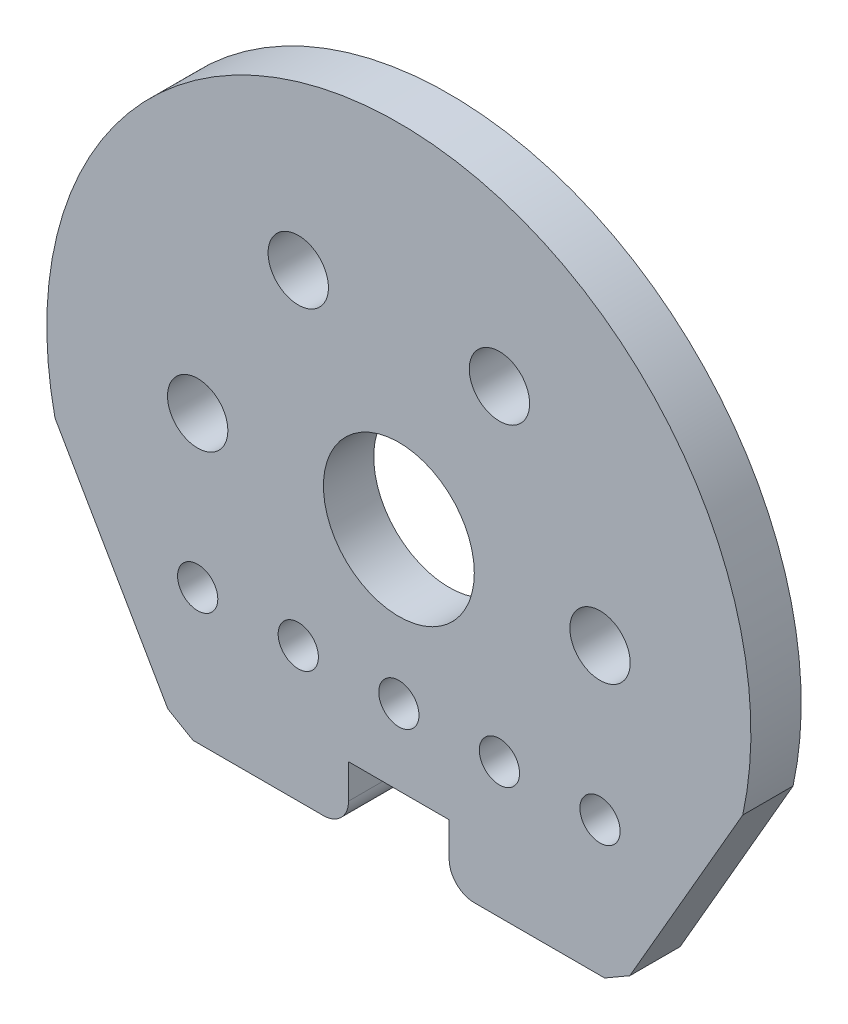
ISO-10303-21;
HEADER;
FILE_DESCRIPTION(('STEP AP214'),'2;1');
FILE_NAME('part.step','',(''),(''),'','','');
FILE_SCHEMA(('AUTOMOTIVE_DESIGN { 1 0 10303 214 1 1 1 1 }'));
ENDSEC;
DATA;
#1=APPLICATION_CONTEXT('core data for automotive mechanical design processes');
#2=APPLICATION_PROTOCOL_DEFINITION('international standard','automotive_design',2000,#1);
#3=PRODUCT_CONTEXT('',#1,'mechanical');
#4=PRODUCT('Part','Part','',(#3));
#5=PRODUCT_RELATED_PRODUCT_CATEGORY('part','',(#4));
#6=PRODUCT_DEFINITION_FORMATION('','',#4);
#7=PRODUCT_DEFINITION_CONTEXT('part definition',#1,'design');
#8=PRODUCT_DEFINITION('design','',#6,#7);
#9=PRODUCT_DEFINITION_SHAPE('','',#8);
#10=(LENGTH_UNIT() NAMED_UNIT(*) SI_UNIT(.MILLI.,.METRE.));
#11=(NAMED_UNIT(*) PLANE_ANGLE_UNIT() SI_UNIT($,.RADIAN.));
#12=(NAMED_UNIT(*) SI_UNIT($,.STERADIAN.) SOLID_ANGLE_UNIT());
#13=UNCERTAINTY_MEASURE_WITH_UNIT(LENGTH_MEASURE(1.E-05),#10,'distance_accuracy_value','');
#14=(GEOMETRIC_REPRESENTATION_CONTEXT(3) GLOBAL_UNCERTAINTY_ASSIGNED_CONTEXT((#13)) GLOBAL_UNIT_ASSIGNED_CONTEXT((#10,
#11,#12)) REPRESENTATION_CONTEXT('',''));
#15=CARTESIAN_POINT('',(0.,0.,0.));
#16=DIRECTION('',(0.,0.,1.));
#17=DIRECTION('',(1.,0.,0.));
#18=AXIS2_PLACEMENT_3D('',#15,#16,#17);
#19=CARTESIAN_POINT('',(0.,0.,10.));
#20=DIRECTION('',(0.,0.,1.));
#21=DIRECTION('',(1.,0.,0.));
#22=AXIS2_PLACEMENT_3D('',#19,#20,#21);
#23=PLANE('',#22);
#24=CARTESIAN_POINT('',(20.,-30.,10.));
#25=DIRECTION('',(0.,0.,1.));
#26=DIRECTION('',(1.,0.,0.));
#27=AXIS2_PLACEMENT_3D('',#24,#25,#26);
#28=CIRCLE('',#27,4.);
#29=CARTESIAN_POINT('',(24.,-30.,10.));
#30=VERTEX_POINT('',#29);
#31=EDGE_CURVE('E316',#30,#30,#28,.T.);
#32=ORIENTED_EDGE('',*,*,#31,.F.);
#33=EDGE_LOOP('',(#32));
#34=FACE_BOUND('',#33,.T.);
#35=CARTESIAN_POINT('',(-20.,-30.,10.));
#36=DIRECTION('',(0.,0.,1.));
#37=DIRECTION('',(1.,0.,0.));
#38=AXIS2_PLACEMENT_3D('',#35,#36,#37);
#39=CIRCLE('',#38,4.);
#40=CARTESIAN_POINT('',(-16.,-30.,10.));
#41=VERTEX_POINT('',#40);
#42=EDGE_CURVE('E328',#41,#41,#39,.T.);
#43=ORIENTED_EDGE('',*,*,#42,.F.);
#44=EDGE_LOOP('',(#43));
#45=FACE_BOUND('',#44,.T.);
#46=CARTESIAN_POINT('',(40.,0.,10.));
#47=DIRECTION('',(0.,0.,1.));
#48=DIRECTION('',(1.,0.,0.));
#49=AXIS2_PLACEMENT_3D('',#46,#47,#48);
#50=CIRCLE('',#49,5.99999999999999);
#51=CARTESIAN_POINT('',(46.,0.,10.));
#52=VERTEX_POINT('',#51);
#53=EDGE_CURVE('E340',#52,#52,#50,.T.);
#54=ORIENTED_EDGE('',*,*,#53,.F.);
#55=EDGE_LOOP('',(#54));
#56=FACE_BOUND('',#55,.T.);
#57=CARTESIAN_POINT('',(-20.0000000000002,34.6410161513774,10.));
#58=DIRECTION('',(0.,0.,1.));
#59=DIRECTION('',(1.,0.,0.));
#60=AXIS2_PLACEMENT_3D('',#57,#58,#59);
#61=CIRCLE('',#60,6.);
#62=CARTESIAN_POINT('',(-14.0000000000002,34.6410161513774,10.));
#63=VERTEX_POINT('',#62);
#64=EDGE_CURVE('E352',#63,#63,#61,.T.);
#65=ORIENTED_EDGE('',*,*,#64,.F.);
#66=EDGE_LOOP('',(#65));
#67=FACE_BOUND('',#66,.T.);
#68=CARTESIAN_POINT('',(0.,0.,10.));
#69=DIRECTION('',(0.,0.,1.));
#70=DIRECTION('',(1.,0.,0.));
#71=AXIS2_PLACEMENT_3D('',#68,#69,#70);
#72=CIRCLE('',#71,15.);
#73=CARTESIAN_POINT('',(15.,0.,10.));
#74=VERTEX_POINT('',#73);
#75=EDGE_CURVE('E158',#74,#74,#72,.T.);
#76=ORIENTED_EDGE('',*,*,#75,.F.);
#77=EDGE_LOOP('',(#76));
#78=FACE_BOUND('',#77,.T.);
#79=CARTESIAN_POINT('',(0.,0.,10.));
#80=DIRECTION('',(0.,0.,1.));
#81=DIRECTION('',(1.,0.,0.));
#82=AXIS2_PLACEMENT_3D('',#79,#80,#81);
#83=CIRCLE('',#82,70.);
#84=CARTESIAN_POINT('',(68.3739716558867,-15.,10.));
#85=VERTEX_POINT('',#84);
#86=CARTESIAN_POINT('',(-68.3739716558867,-15.,10.));
#87=VERTEX_POINT('',#86);
#88=EDGE_CURVE('E177',#85,#87,#83,.T.);
#89=ORIENTED_EDGE('',*,*,#88,.T.);
#90=DIRECTION('',(0.500000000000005,-0.866025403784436,0.));
#91=VECTOR('',#90,1.);
#92=CARTESIAN_POINT('',(-68.3739716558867,-15.,10.));
#93=LINE('',#92,#91);
#94=CARTESIAN_POINT('',(-45.9156731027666,-53.8989141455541,10.));
#95=VERTEX_POINT('',#94);
#96=EDGE_CURVE('E105',#87,#95,#93,.T.);
#97=ORIENTED_EDGE('',*,*,#96,.T.);
#98=DIRECTION('',(0.866025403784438,-0.500000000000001,0.));
#99=VECTOR('',#98,1.);
#100=CARTESIAN_POINT('',(-45.9156731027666,-53.8989141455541,10.));
#101=LINE('',#100,#99);
#102=CARTESIAN_POINT('',(-40.9156731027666,-56.7856654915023,10.));
#103=VERTEX_POINT('',#102);
#104=EDGE_CURVE('E204',#95,#103,#101,.T.);
#105=ORIENTED_EDGE('',*,*,#104,.T.);
#106=DIRECTION('',(1.,0.,0.));
#107=VECTOR('',#106,1.);
#108=CARTESIAN_POINT('',(-40.9156731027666,-56.7856654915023,10.));
#109=LINE('',#108,#107);
#110=CARTESIAN_POINT('',(-15.,-56.7856654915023,10.));
#111=VERTEX_POINT('',#110);
#112=EDGE_CURVE('E223',#103,#111,#109,.T.);
#113=ORIENTED_EDGE('',*,*,#112,.T.);
#114=CARTESIAN_POINT('',(-15.,-51.7856654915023,10.));
#115=DIRECTION('',(0.,0.,1.));
#116=DIRECTION('',(1.,0.,0.));
#117=AXIS2_PLACEMENT_3D('',#114,#115,#116);
#118=CIRCLE('',#117,5.);
#119=CARTESIAN_POINT('',(-9.99999999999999,-51.7856654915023,10.));
#120=VERTEX_POINT('',#119);
#121=EDGE_CURVE('E220',#111,#120,#118,.T.);
#122=ORIENTED_EDGE('',*,*,#121,.T.);
#123=DIRECTION('',(0.,1.,0.));
#124=VECTOR('',#123,1.);
#125=CARTESIAN_POINT('',(-9.99999999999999,-51.7856654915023,10.));
#126=LINE('',#125,#124);
#127=CARTESIAN_POINT('',(-9.99999999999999,-45.,10.));
#128=VERTEX_POINT('',#127);
#129=EDGE_CURVE('E222',#120,#128,#126,.T.);
#130=ORIENTED_EDGE('',*,*,#129,.T.);
#131=DIRECTION('',(1.,0.,0.));
#132=VECTOR('',#131,1.);
#133=CARTESIAN_POINT('',(-9.99999999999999,-45.,10.));
#134=LINE('',#133,#132);
#135=CARTESIAN_POINT('',(10.,-45.,10.));
#136=VERTEX_POINT('',#135);
#137=EDGE_CURVE('E225',#128,#136,#134,.T.);
#138=ORIENTED_EDGE('',*,*,#137,.T.);
#139=DIRECTION('',(0.,-1.,0.));
#140=VECTOR('',#139,1.);
#141=CARTESIAN_POINT('',(10.,-51.7856654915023,10.));
#142=LINE('',#141,#140);
#143=CARTESIAN_POINT('',(10.,-51.7856654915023,10.));
#144=VERTEX_POINT('',#143);
#145=EDGE_CURVE('E231',#136,#144,#142,.T.);
#146=ORIENTED_EDGE('',*,*,#145,.T.);
#147=CARTESIAN_POINT('',(15.,-51.7856654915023,10.));
#148=DIRECTION('',(0.,0.,1.));
#149=DIRECTION('',(-1.,0.,0.));
#150=AXIS2_PLACEMENT_3D('',#147,#148,#149);
#151=CIRCLE('',#150,5.);
#152=CARTESIAN_POINT('',(15.,-56.7856654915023,10.));
#153=VERTEX_POINT('',#152);
#154=EDGE_CURVE('E136',#144,#153,#151,.T.);
#155=ORIENTED_EDGE('',*,*,#154,.T.);
#156=DIRECTION('',(1.,0.,0.));
#157=VECTOR('',#156,1.);
#158=CARTESIAN_POINT('',(40.9156731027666,-56.7856654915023,10.));
#159=LINE('',#158,#157);
#160=CARTESIAN_POINT('',(40.9156731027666,-56.7856654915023,10.));
#161=VERTEX_POINT('',#160);
#162=EDGE_CURVE('E130',#153,#161,#159,.T.);
#163=ORIENTED_EDGE('',*,*,#162,.T.);
#164=DIRECTION('',(0.866025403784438,0.500000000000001,0.));
#165=VECTOR('',#164,1.);
#166=CARTESIAN_POINT('',(45.9156731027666,-53.8989141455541,10.));
#167=LINE('',#166,#165);
#168=CARTESIAN_POINT('',(45.9156731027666,-53.8989141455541,10.));
#169=VERTEX_POINT('',#168);
#170=EDGE_CURVE('E134',#161,#169,#167,.T.);
#171=ORIENTED_EDGE('',*,*,#170,.T.);
#172=DIRECTION('',(0.500000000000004,0.866025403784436,0.));
#173=VECTOR('',#172,1.);
#174=CARTESIAN_POINT('',(68.3739716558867,-15.,10.));
#175=LINE('',#174,#173);
#176=EDGE_CURVE('E50',#169,#85,#175,.T.);
#177=ORIENTED_EDGE('',*,*,#176,.T.);
#178=EDGE_LOOP('',(#89,#97,#105,#113,#122,#130,#138,#146,#155,#163,#171,#177));
#179=FACE_BOUND('',#178,.T.);
#180=CARTESIAN_POINT('',(-40.,0.,10.));
#181=DIRECTION('',(0.,0.,1.));
#182=DIRECTION('',(1.,0.,0.));
#183=AXIS2_PLACEMENT_3D('',#180,#181,#182);
#184=CIRCLE('',#183,5.99999999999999);
#185=CARTESIAN_POINT('',(-34.,0.,10.));
#186=VERTEX_POINT('',#185);
#187=EDGE_CURVE('E358',#186,#186,#184,.T.);
#188=ORIENTED_EDGE('',*,*,#187,.F.);
#189=EDGE_LOOP('',(#188));
#190=FACE_BOUND('',#189,.T.);
#191=CARTESIAN_POINT('',(19.9999999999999,34.6410161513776,10.));
#192=DIRECTION('',(0.,0.,1.));
#193=DIRECTION('',(1.,0.,0.));
#194=AXIS2_PLACEMENT_3D('',#191,#192,#193);
#195=CIRCLE('',#194,6.);
#196=CARTESIAN_POINT('',(25.9999999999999,34.6410161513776,10.));
#197=VERTEX_POINT('',#196);
#198=EDGE_CURVE('E346',#197,#197,#195,.T.);
#199=ORIENTED_EDGE('',*,*,#198,.F.);
#200=EDGE_LOOP('',(#199));
#201=FACE_BOUND('',#200,.T.);
#202=CARTESIAN_POINT('',(-40.,-30.,10.));
#203=DIRECTION('',(0.,0.,1.));
#204=DIRECTION('',(1.,0.,0.));
#205=AXIS2_PLACEMENT_3D('',#202,#203,#204);
#206=CIRCLE('',#205,4.);
#207=CARTESIAN_POINT('',(-36.,-30.,10.));
#208=VERTEX_POINT('',#207);
#209=EDGE_CURVE('E334',#208,#208,#206,.T.);
#210=ORIENTED_EDGE('',*,*,#209,.F.);
#211=EDGE_LOOP('',(#210));
#212=FACE_BOUND('',#211,.T.);
#213=CARTESIAN_POINT('',(0.,-30.,10.));
#214=DIRECTION('',(0.,0.,1.));
#215=DIRECTION('',(1.,0.,0.));
#216=AXIS2_PLACEMENT_3D('',#213,#214,#215);
#217=CIRCLE('',#216,4.);
#218=CARTESIAN_POINT('',(4.,-30.,10.));
#219=VERTEX_POINT('',#218);
#220=EDGE_CURVE('E322',#219,#219,#217,.T.);
#221=ORIENTED_EDGE('',*,*,#220,.F.);
#222=EDGE_LOOP('',(#221));
#223=FACE_BOUND('',#222,.T.);
#224=CARTESIAN_POINT('',(40.,-30.,10.));
#225=DIRECTION('',(0.,0.,1.));
#226=DIRECTION('',(1.,0.,0.));
#227=AXIS2_PLACEMENT_3D('',#224,#225,#226);
#228=CIRCLE('',#227,4.);
#229=CARTESIAN_POINT('',(44.,-30.,10.));
#230=VERTEX_POINT('',#229);
#231=EDGE_CURVE('E307',#230,#230,#228,.T.);
#232=ORIENTED_EDGE('',*,*,#231,.F.);
#233=EDGE_LOOP('',(#232));
#234=FACE_BOUND('',#233,.T.);
#235=ADVANCED_FACE('F33',(#34,#45,#56,#67,#78,#179,#190,#201,#212,#223,#234),#23,.T.);
#236=CARTESIAN_POINT('',(0.,0.,0.));
#237=DIRECTION('',(0.,0.,1.));
#238=DIRECTION('',(1.,0.,0.));
#239=AXIS2_PLACEMENT_3D('',#236,#237,#238);
#240=PLANE('',#239);
#241=CARTESIAN_POINT('',(20.,-30.,0.));
#242=DIRECTION('',(0.,0.,1.));
#243=DIRECTION('',(1.,0.,0.));
#244=AXIS2_PLACEMENT_3D('',#241,#242,#243);
#245=CIRCLE('',#244,4.);
#246=CARTESIAN_POINT('',(24.,-30.,0.));
#247=VERTEX_POINT('',#246);
#248=EDGE_CURVE('E313',#247,#247,#245,.T.);
#249=ORIENTED_EDGE('',*,*,#248,.T.);
#250=EDGE_LOOP('',(#249));
#251=FACE_BOUND('',#250,.T.);
#252=CARTESIAN_POINT('',(-20.,-30.,0.));
#253=DIRECTION('',(0.,0.,1.));
#254=DIRECTION('',(1.,0.,0.));
#255=AXIS2_PLACEMENT_3D('',#252,#253,#254);
#256=CIRCLE('',#255,4.);
#257=CARTESIAN_POINT('',(-16.,-30.,0.));
#258=VERTEX_POINT('',#257);
#259=EDGE_CURVE('E325',#258,#258,#256,.T.);
#260=ORIENTED_EDGE('',*,*,#259,.T.);
#261=EDGE_LOOP('',(#260));
#262=FACE_BOUND('',#261,.T.);
#263=CARTESIAN_POINT('',(40.,0.,0.));
#264=DIRECTION('',(0.,0.,1.));
#265=DIRECTION('',(1.,0.,0.));
#266=AXIS2_PLACEMENT_3D('',#263,#264,#265);
#267=CIRCLE('',#266,5.99999999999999);
#268=CARTESIAN_POINT('',(46.,0.,0.));
#269=VERTEX_POINT('',#268);
#270=EDGE_CURVE('E337',#269,#269,#267,.T.);
#271=ORIENTED_EDGE('',*,*,#270,.T.);
#272=EDGE_LOOP('',(#271));
#273=FACE_BOUND('',#272,.T.);
#274=CARTESIAN_POINT('',(-20.0000000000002,34.6410161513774,0.));
#275=DIRECTION('',(0.,0.,1.));
#276=DIRECTION('',(1.,0.,0.));
#277=AXIS2_PLACEMENT_3D('',#274,#275,#276);
#278=CIRCLE('',#277,6.);
#279=CARTESIAN_POINT('',(-14.0000000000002,34.6410161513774,0.));
#280=VERTEX_POINT('',#279);
#281=EDGE_CURVE('E349',#280,#280,#278,.T.);
#282=ORIENTED_EDGE('',*,*,#281,.T.);
#283=EDGE_LOOP('',(#282));
#284=FACE_BOUND('',#283,.T.);
#285=CARTESIAN_POINT('',(0.,0.,0.));
#286=DIRECTION('',(0.,0.,1.));
#287=DIRECTION('',(1.,0.,0.));
#288=AXIS2_PLACEMENT_3D('',#285,#286,#287);
#289=CIRCLE('',#288,15.);
#290=CARTESIAN_POINT('',(15.,0.,0.));
#291=VERTEX_POINT('',#290);
#292=EDGE_CURVE('E361',#291,#291,#289,.T.);
#293=ORIENTED_EDGE('',*,*,#292,.T.);
#294=EDGE_LOOP('',(#293));
#295=FACE_BOUND('',#294,.T.);
#296=CARTESIAN_POINT('',(0.,0.,0.));
#297=DIRECTION('',(0.,0.,1.));
#298=DIRECTION('',(1.,0.,0.));
#299=AXIS2_PLACEMENT_3D('',#296,#297,#298);
#300=CIRCLE('',#299,70.);
#301=CARTESIAN_POINT('',(68.3739716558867,-15.,0.));
#302=VERTEX_POINT('',#301);
#303=CARTESIAN_POINT('',(-68.3739716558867,-15.,0.));
#304=VERTEX_POINT('',#303);
#305=EDGE_CURVE('E154',#302,#304,#300,.T.);
#306=ORIENTED_EDGE('',*,*,#305,.F.);
#307=DIRECTION('',(0.500000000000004,0.866025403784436,0.));
#308=VECTOR('',#307,1.);
#309=CARTESIAN_POINT('',(68.3739716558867,-15.,0.));
#310=LINE('',#309,#308);
#311=CARTESIAN_POINT('',(45.9156731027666,-53.8989141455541,0.));
#312=VERTEX_POINT('',#311);
#313=EDGE_CURVE('E97',#312,#302,#310,.T.);
#314=ORIENTED_EDGE('',*,*,#313,.F.);
#315=DIRECTION('',(0.866025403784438,0.500000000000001,0.));
#316=VECTOR('',#315,1.);
#317=CARTESIAN_POINT('',(45.9156731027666,-53.8989141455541,0.));
#318=LINE('',#317,#316);
#319=CARTESIAN_POINT('',(40.9156731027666,-56.7856654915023,0.));
#320=VERTEX_POINT('',#319);
#321=EDGE_CURVE('E91',#320,#312,#318,.T.);
#322=ORIENTED_EDGE('',*,*,#321,.F.);
#323=DIRECTION('',(1.,0.,0.));
#324=VECTOR('',#323,1.);
#325=CARTESIAN_POINT('',(40.9156731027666,-56.7856654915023,0.));
#326=LINE('',#325,#324);
#327=CARTESIAN_POINT('',(15.,-56.7856654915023,0.));
#328=VERTEX_POINT('',#327);
#329=EDGE_CURVE('E144',#328,#320,#326,.T.);
#330=ORIENTED_EDGE('',*,*,#329,.F.);
#331=CARTESIAN_POINT('',(15.,-51.7856654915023,0.));
#332=DIRECTION('',(0.,0.,1.));
#333=DIRECTION('',(-1.,0.,0.));
#334=AXIS2_PLACEMENT_3D('',#331,#332,#333);
#335=CIRCLE('',#334,5.);
#336=CARTESIAN_POINT('',(10.,-51.7856654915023,0.));
#337=VERTEX_POINT('',#336);
#338=EDGE_CURVE('E172',#337,#328,#335,.T.);
#339=ORIENTED_EDGE('',*,*,#338,.F.);
#340=DIRECTION('',(0.,-1.,0.));
#341=VECTOR('',#340,1.);
#342=CARTESIAN_POINT('',(10.,-51.7856654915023,0.));
#343=LINE('',#342,#341);
#344=CARTESIAN_POINT('',(10.,-45.,0.));
#345=VERTEX_POINT('',#344);
#346=EDGE_CURVE('E170',#345,#337,#343,.T.);
#347=ORIENTED_EDGE('',*,*,#346,.F.);
#348=DIRECTION('',(1.,0.,0.));
#349=VECTOR('',#348,1.);
#350=CARTESIAN_POINT('',(-9.99999999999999,-45.,0.));
#351=LINE('',#350,#349);
#352=CARTESIAN_POINT('',(-9.99999999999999,-45.,0.));
#353=VERTEX_POINT('',#352);
#354=EDGE_CURVE('E168',#353,#345,#351,.T.);
#355=ORIENTED_EDGE('',*,*,#354,.F.);
#356=DIRECTION('',(0.,1.,0.));
#357=VECTOR('',#356,1.);
#358=CARTESIAN_POINT('',(-9.99999999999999,-51.7856654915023,0.));
#359=LINE('',#358,#357);
#360=CARTESIAN_POINT('',(-9.99999999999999,-51.7856654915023,0.));
#361=VERTEX_POINT('',#360);
#362=EDGE_CURVE('E166',#361,#353,#359,.T.);
#363=ORIENTED_EDGE('',*,*,#362,.F.);
#364=CARTESIAN_POINT('',(-15.,-51.7856654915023,0.));
#365=DIRECTION('',(0.,0.,1.));
#366=DIRECTION('',(1.,0.,0.));
#367=AXIS2_PLACEMENT_3D('',#364,#365,#366);
#368=CIRCLE('',#367,5.);
#369=CARTESIAN_POINT('',(-15.,-56.7856654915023,0.));
#370=VERTEX_POINT('',#369);
#371=EDGE_CURVE('E164',#370,#361,#368,.T.);
#372=ORIENTED_EDGE('',*,*,#371,.F.);
#373=DIRECTION('',(1.,0.,0.));
#374=VECTOR('',#373,1.);
#375=CARTESIAN_POINT('',(-40.9156731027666,-56.7856654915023,0.));
#376=LINE('',#375,#374);
#377=CARTESIAN_POINT('',(-40.9156731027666,-56.7856654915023,0.));
#378=VERTEX_POINT('',#377);
#379=EDGE_CURVE('E162',#378,#370,#376,.T.);
#380=ORIENTED_EDGE('',*,*,#379,.F.);
#381=DIRECTION('',(0.866025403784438,-0.500000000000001,0.));
#382=VECTOR('',#381,1.);
#383=CARTESIAN_POINT('',(-45.9156731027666,-53.8989141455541,0.));
#384=LINE('',#383,#382);
#385=CARTESIAN_POINT('',(-45.9156731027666,-53.8989141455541,0.));
#386=VERTEX_POINT('',#385);
#387=EDGE_CURVE('E160',#386,#378,#384,.T.);
#388=ORIENTED_EDGE('',*,*,#387,.F.);
#389=DIRECTION('',(0.500000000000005,-0.866025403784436,0.));
#390=VECTOR('',#389,1.);
#391=CARTESIAN_POINT('',(-68.3739716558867,-15.,0.));
#392=LINE('',#391,#390);
#393=EDGE_CURVE('E157',#304,#386,#392,.T.);
#394=ORIENTED_EDGE('',*,*,#393,.F.);
#395=EDGE_LOOP('',(#306,#314,#322,#330,#339,#347,#355,#363,#372,#380,#388,#394));
#396=FACE_BOUND('',#395,.T.);
#397=CARTESIAN_POINT('',(-40.,0.,0.));
#398=DIRECTION('',(0.,0.,1.));
#399=DIRECTION('',(1.,0.,0.));
#400=AXIS2_PLACEMENT_3D('',#397,#398,#399);
#401=CIRCLE('',#400,5.99999999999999);
#402=CARTESIAN_POINT('',(-34.,0.,0.));
#403=VERTEX_POINT('',#402);
#404=EDGE_CURVE('E355',#403,#403,#401,.T.);
#405=ORIENTED_EDGE('',*,*,#404,.T.);
#406=EDGE_LOOP('',(#405));
#407=FACE_BOUND('',#406,.T.);
#408=CARTESIAN_POINT('',(19.9999999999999,34.6410161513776,0.));
#409=DIRECTION('',(0.,0.,1.));
#410=DIRECTION('',(1.,0.,0.));
#411=AXIS2_PLACEMENT_3D('',#408,#409,#410);
#412=CIRCLE('',#411,6.);
#413=CARTESIAN_POINT('',(25.9999999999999,34.6410161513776,0.));
#414=VERTEX_POINT('',#413);
#415=EDGE_CURVE('E343',#414,#414,#412,.T.);
#416=ORIENTED_EDGE('',*,*,#415,.T.);
#417=EDGE_LOOP('',(#416));
#418=FACE_BOUND('',#417,.T.);
#419=CARTESIAN_POINT('',(-40.,-30.,0.));
#420=DIRECTION('',(0.,0.,1.));
#421=DIRECTION('',(1.,0.,0.));
#422=AXIS2_PLACEMENT_3D('',#419,#420,#421);
#423=CIRCLE('',#422,4.);
#424=CARTESIAN_POINT('',(-36.,-30.,0.));
#425=VERTEX_POINT('',#424);
#426=EDGE_CURVE('E331',#425,#425,#423,.T.);
#427=ORIENTED_EDGE('',*,*,#426,.T.);
#428=EDGE_LOOP('',(#427));
#429=FACE_BOUND('',#428,.T.);
#430=CARTESIAN_POINT('',(0.,-30.,0.));
#431=DIRECTION('',(0.,0.,1.));
#432=DIRECTION('',(1.,0.,0.));
#433=AXIS2_PLACEMENT_3D('',#430,#431,#432);
#434=CIRCLE('',#433,4.);
#435=CARTESIAN_POINT('',(4.,-30.,0.));
#436=VERTEX_POINT('',#435);
#437=EDGE_CURVE('E319',#436,#436,#434,.T.);
#438=ORIENTED_EDGE('',*,*,#437,.T.);
#439=EDGE_LOOP('',(#438));
#440=FACE_BOUND('',#439,.T.);
#441=CARTESIAN_POINT('',(40.,-30.,0.));
#442=DIRECTION('',(0.,0.,1.));
#443=DIRECTION('',(1.,0.,0.));
#444=AXIS2_PLACEMENT_3D('',#441,#442,#443);
#445=CIRCLE('',#444,4.);
#446=CARTESIAN_POINT('',(44.,-30.,0.));
#447=VERTEX_POINT('',#446);
#448=EDGE_CURVE('E310',#447,#447,#445,.T.);
#449=ORIENTED_EDGE('',*,*,#448,.T.);
#450=EDGE_LOOP('',(#449));
#451=FACE_BOUND('',#450,.T.);
#452=ADVANCED_FACE('F208',(#251,#262,#273,#284,#295,#396,#407,#418,#429,#440,#451),#240,.F.);
#453=CARTESIAN_POINT('',(0.,0.,10.));
#454=DIRECTION('',(0.,0.,-1.));
#455=DIRECTION('',(-1.,0.,0.));
#456=AXIS2_PLACEMENT_3D('',#453,#454,#455);
#457=CYLINDRICAL_SURFACE('',#456,70.);
#458=ORIENTED_EDGE('',*,*,#305,.T.);
#459=DIRECTION('',(0.,0.,-1.));
#460=VECTOR('',#459,1.);
#461=CARTESIAN_POINT('',(-68.3739716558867,-15.,10.));
#462=LINE('',#461,#460);
#463=EDGE_CURVE('E11',#87,#304,#462,.T.);
#464=ORIENTED_EDGE('',*,*,#463,.F.);
#465=ORIENTED_EDGE('',*,*,#88,.F.);
#466=DIRECTION('',(0.,0.,-1.));
#467=VECTOR('',#466,1.);
#468=CARTESIAN_POINT('',(68.3739716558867,-15.,10.));
#469=LINE('',#468,#467);
#470=EDGE_CURVE('E150',#85,#302,#469,.T.);
#471=ORIENTED_EDGE('',*,*,#470,.T.);
#472=EDGE_LOOP('',(#458,#464,#465,#471));
#473=FACE_BOUND('',#472,.T.);
#474=ADVANCED_FACE('F35',(#473),#457,.T.);
#475=CARTESIAN_POINT('',(-68.3739716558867,-15.,10.));
#476=DIRECTION('',(0.866025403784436,0.500000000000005,0.));
#477=DIRECTION('',(-0.500000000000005,0.866025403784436,0.));
#478=AXIS2_PLACEMENT_3D('',#475,#476,#477);
#479=PLANE('',#478);
#480=ORIENTED_EDGE('',*,*,#393,.T.);
#481=DIRECTION('',(0.,0.,-1.));
#482=VECTOR('',#481,1.);
#483=CARTESIAN_POINT('',(-45.9156731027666,-53.8989141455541,10.));
#484=LINE('',#483,#482);
#485=EDGE_CURVE('E42',#95,#386,#484,.T.);
#486=ORIENTED_EDGE('',*,*,#485,.F.);
#487=ORIENTED_EDGE('',*,*,#96,.F.);
#488=ORIENTED_EDGE('',*,*,#463,.T.);
#489=EDGE_LOOP('',(#480,#486,#487,#488));
#490=FACE_BOUND('',#489,.T.);
#491=ADVANCED_FACE('F524',(#490),#479,.F.);
#492=CARTESIAN_POINT('',(-45.9156731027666,-53.8989141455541,10.));
#493=DIRECTION('',(0.500000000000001,0.866025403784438,0.));
#494=DIRECTION('',(-0.866025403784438,0.500000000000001,0.));
#495=AXIS2_PLACEMENT_3D('',#492,#493,#494);
#496=PLANE('',#495);
#497=ORIENTED_EDGE('',*,*,#387,.T.);
#498=DIRECTION('',(0.,0.,-1.));
#499=VECTOR('',#498,1.);
#500=CARTESIAN_POINT('',(-40.9156731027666,-56.7856654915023,10.));
#501=LINE('',#500,#499);
#502=EDGE_CURVE('E196',#103,#378,#501,.T.);
#503=ORIENTED_EDGE('',*,*,#502,.F.);
#504=ORIENTED_EDGE('',*,*,#104,.F.);
#505=ORIENTED_EDGE('',*,*,#485,.T.);
#506=EDGE_LOOP('',(#497,#503,#504,#505));
#507=FACE_BOUND('',#506,.T.);
#508=ADVANCED_FACE('F202',(#507),#496,.F.);
#509=CARTESIAN_POINT('',(-40.9156731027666,-56.7856654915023,10.));
#510=DIRECTION('',(0.,1.,0.));
#511=DIRECTION('',(-1.,0.,0.));
#512=AXIS2_PLACEMENT_3D('',#509,#510,#511);
#513=PLANE('',#512);
#514=ORIENTED_EDGE('',*,*,#379,.T.);
#515=DIRECTION('',(0.,0.,-1.));
#516=VECTOR('',#515,1.);
#517=CARTESIAN_POINT('',(-15.,-56.7856654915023,10.));
#518=LINE('',#517,#516);
#519=EDGE_CURVE('E193',#111,#370,#518,.T.);
#520=ORIENTED_EDGE('',*,*,#519,.F.);
#521=ORIENTED_EDGE('',*,*,#112,.F.);
#522=ORIENTED_EDGE('',*,*,#502,.T.);
#523=EDGE_LOOP('',(#514,#520,#521,#522));
#524=FACE_BOUND('',#523,.T.);
#525=ADVANCED_FACE('F214',(#524),#513,.F.);
#526=CARTESIAN_POINT('',(-15.,-51.7856654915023,10.));
#527=DIRECTION('',(0.,0.,-1.));
#528=DIRECTION('',(-1.,0.,0.));
#529=AXIS2_PLACEMENT_3D('',#526,#527,#528);
#530=CYLINDRICAL_SURFACE('',#529,5.);
#531=ORIENTED_EDGE('',*,*,#371,.T.);
#532=DIRECTION('',(0.,0.,-1.));
#533=VECTOR('',#532,1.);
#534=CARTESIAN_POINT('',(-9.99999999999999,-51.7856654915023,10.));
#535=LINE('',#534,#533);
#536=EDGE_CURVE('E190',#120,#361,#535,.T.);
#537=ORIENTED_EDGE('',*,*,#536,.F.);
#538=ORIENTED_EDGE('',*,*,#121,.F.);
#539=ORIENTED_EDGE('',*,*,#519,.T.);
#540=EDGE_LOOP('',(#531,#537,#538,#539));
#541=FACE_BOUND('',#540,.T.);
#542=ADVANCED_FACE('F218',(#541),#530,.T.);
#543=CARTESIAN_POINT('',(-9.99999999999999,-51.7856654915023,10.));
#544=DIRECTION('',(-1.,0.,0.));
#545=DIRECTION('',(0.,0.,1.));
#546=AXIS2_PLACEMENT_3D('',#543,#544,#545);
#547=PLANE('',#546);
#548=ORIENTED_EDGE('',*,*,#362,.T.);
#549=DIRECTION('',(0.,0.,-1.));
#550=VECTOR('',#549,1.);
#551=CARTESIAN_POINT('',(-9.99999999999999,-45.,10.));
#552=LINE('',#551,#550);
#553=EDGE_CURVE('E187',#128,#353,#552,.T.);
#554=ORIENTED_EDGE('',*,*,#553,.F.);
#555=ORIENTED_EDGE('',*,*,#129,.F.);
#556=ORIENTED_EDGE('',*,*,#536,.T.);
#557=EDGE_LOOP('',(#548,#554,#555,#556));
#558=FACE_BOUND('',#557,.T.);
#559=ADVANCED_FACE('F489',(#558),#547,.F.);
#560=CARTESIAN_POINT('',(-9.99999999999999,-45.,10.));
#561=DIRECTION('',(0.,1.,0.));
#562=DIRECTION('',(0.,0.,1.));
#563=AXIS2_PLACEMENT_3D('',#560,#561,#562);
#564=PLANE('',#563);
#565=ORIENTED_EDGE('',*,*,#354,.T.);
#566=DIRECTION('',(0.,0.,-1.));
#567=VECTOR('',#566,1.);
#568=CARTESIAN_POINT('',(10.,-45.,10.));
#569=LINE('',#568,#567);
#570=EDGE_CURVE('E184',#136,#345,#569,.T.);
#571=ORIENTED_EDGE('',*,*,#570,.F.);
#572=ORIENTED_EDGE('',*,*,#137,.F.);
#573=ORIENTED_EDGE('',*,*,#553,.T.);
#574=EDGE_LOOP('',(#565,#571,#572,#573));
#575=FACE_BOUND('',#574,.T.);
#576=ADVANCED_FACE('F480',(#575),#564,.F.);
#577=CARTESIAN_POINT('',(10.,-51.7856654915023,10.));
#578=DIRECTION('',(1.,0.,0.));
#579=DIRECTION('',(0.,1.,0.));
#580=AXIS2_PLACEMENT_3D('',#577,#578,#579);
#581=PLANE('',#580);
#582=ORIENTED_EDGE('',*,*,#346,.T.);
#583=DIRECTION('',(0.,0.,-1.));
#584=VECTOR('',#583,1.);
#585=CARTESIAN_POINT('',(10.,-51.7856654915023,10.));
#586=LINE('',#585,#584);
#587=EDGE_CURVE('E181',#144,#337,#586,.T.);
#588=ORIENTED_EDGE('',*,*,#587,.F.);
#589=ORIENTED_EDGE('',*,*,#145,.F.);
#590=ORIENTED_EDGE('',*,*,#570,.T.);
#591=EDGE_LOOP('',(#582,#588,#589,#590));
#592=FACE_BOUND('',#591,.T.);
#593=ADVANCED_FACE('F237',(#592),#581,.F.);
#594=CARTESIAN_POINT('',(15.,-51.7856654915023,10.));
#595=DIRECTION('',(0.,0.,-1.));
#596=DIRECTION('',(-1.,0.,0.));
#597=AXIS2_PLACEMENT_3D('',#594,#595,#596);
#598=CYLINDRICAL_SURFACE('',#597,5.);
#599=ORIENTED_EDGE('',*,*,#338,.T.);
#600=DIRECTION('',(0.,0.,-1.));
#601=VECTOR('',#600,1.);
#602=CARTESIAN_POINT('',(15.,-56.7856654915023,10.));
#603=LINE('',#602,#601);
#604=EDGE_CURVE('E145',#153,#328,#603,.T.);
#605=ORIENTED_EDGE('',*,*,#604,.F.);
#606=ORIENTED_EDGE('',*,*,#154,.F.);
#607=ORIENTED_EDGE('',*,*,#587,.T.);
#608=EDGE_LOOP('',(#599,#605,#606,#607));
#609=FACE_BOUND('',#608,.T.);
#610=ADVANCED_FACE('F241',(#609),#598,.T.);
#611=CARTESIAN_POINT('',(40.9156731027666,-56.7856654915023,10.));
#612=DIRECTION('',(0.,1.,0.));
#613=DIRECTION('',(-1.,0.,0.));
#614=AXIS2_PLACEMENT_3D('',#611,#612,#613);
#615=PLANE('',#614);
#616=ORIENTED_EDGE('',*,*,#329,.T.);
#617=DIRECTION('',(0.,0.,-1.));
#618=VECTOR('',#617,1.);
#619=CARTESIAN_POINT('',(40.9156731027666,-56.7856654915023,10.));
#620=LINE('',#619,#618);
#621=EDGE_CURVE('E141',#161,#320,#620,.T.);
#622=ORIENTED_EDGE('',*,*,#621,.F.);
#623=ORIENTED_EDGE('',*,*,#162,.F.);
#624=ORIENTED_EDGE('',*,*,#604,.T.);
#625=EDGE_LOOP('',(#616,#622,#623,#624));
#626=FACE_BOUND('',#625,.T.);
#627=ADVANCED_FACE('F142',(#626),#615,.F.);
#628=CARTESIAN_POINT('',(45.9156731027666,-53.8989141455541,10.));
#629=DIRECTION('',(-0.500000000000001,0.866025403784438,0.));
#630=DIRECTION('',(-0.866025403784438,-0.500000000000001,0.));
#631=AXIS2_PLACEMENT_3D('',#628,#629,#630);
#632=PLANE('',#631);
#633=ORIENTED_EDGE('',*,*,#321,.T.);
#634=DIRECTION('',(0.,0.,-1.));
#635=VECTOR('',#634,1.);
#636=CARTESIAN_POINT('',(45.9156731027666,-53.8989141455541,10.));
#637=LINE('',#636,#635);
#638=EDGE_CURVE('E146',#169,#312,#637,.T.);
#639=ORIENTED_EDGE('',*,*,#638,.F.);
#640=ORIENTED_EDGE('',*,*,#170,.F.);
#641=ORIENTED_EDGE('',*,*,#621,.T.);
#642=EDGE_LOOP('',(#633,#639,#640,#641));
#643=FACE_BOUND('',#642,.T.);
#644=ADVANCED_FACE('F148',(#643),#632,.F.);
#645=CARTESIAN_POINT('',(68.3739716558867,-15.,10.));
#646=DIRECTION('',(-0.866025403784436,0.500000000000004,0.));
#647=DIRECTION('',(-0.500000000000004,-0.866025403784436,0.));
#648=AXIS2_PLACEMENT_3D('',#645,#646,#647);
#649=PLANE('',#648);
#650=ORIENTED_EDGE('',*,*,#313,.T.);
#651=ORIENTED_EDGE('',*,*,#470,.F.);
#652=ORIENTED_EDGE('',*,*,#176,.F.);
#653=ORIENTED_EDGE('',*,*,#638,.T.);
#654=EDGE_LOOP('',(#650,#651,#652,#653));
#655=FACE_BOUND('',#654,.T.);
#656=ADVANCED_FACE('F245',(#655),#649,.F.);
#657=CARTESIAN_POINT('',(0.,0.,10.));
#658=DIRECTION('',(0.,0.,-1.));
#659=DIRECTION('',(-1.,0.,0.));
#660=AXIS2_PLACEMENT_3D('',#657,#658,#659);
#661=CYLINDRICAL_SURFACE('',#660,15.);
#662=ORIENTED_EDGE('',*,*,#75,.T.);
#663=EDGE_LOOP('',(#662));
#664=FACE_BOUND('',#663,.T.);
#665=ORIENTED_EDGE('',*,*,#292,.F.);
#666=EDGE_LOOP('',(#665));
#667=FACE_BOUND('',#666,.T.);
#668=ADVANCED_FACE('F247',(#664,#667),#661,.F.);
#669=CARTESIAN_POINT('',(-40.,0.,10.));
#670=DIRECTION('',(0.,0.,-1.));
#671=DIRECTION('',(-1.,0.,0.));
#672=AXIS2_PLACEMENT_3D('',#669,#670,#671);
#673=CYLINDRICAL_SURFACE('',#672,5.99999999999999);
#674=ORIENTED_EDGE('',*,*,#187,.T.);
#675=EDGE_LOOP('',(#674));
#676=FACE_BOUND('',#675,.T.);
#677=ORIENTED_EDGE('',*,*,#404,.F.);
#678=EDGE_LOOP('',(#677));
#679=FACE_BOUND('',#678,.T.);
#680=ADVANCED_FACE('F253',(#676,#679),#673,.F.);
#681=CARTESIAN_POINT('',(-20.0000000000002,34.6410161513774,10.));
#682=DIRECTION('',(0.,0.,-1.));
#683=DIRECTION('',(-1.,0.,0.));
#684=AXIS2_PLACEMENT_3D('',#681,#682,#683);
#685=CYLINDRICAL_SURFACE('',#684,6.);
#686=ORIENTED_EDGE('',*,*,#64,.T.);
#687=EDGE_LOOP('',(#686));
#688=FACE_BOUND('',#687,.T.);
#689=ORIENTED_EDGE('',*,*,#281,.F.);
#690=EDGE_LOOP('',(#689));
#691=FACE_BOUND('',#690,.T.);
#692=ADVANCED_FACE('F270',(#688,#691),#685,.F.);
#693=CARTESIAN_POINT('',(19.9999999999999,34.6410161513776,10.));
#694=DIRECTION('',(0.,0.,-1.));
#695=DIRECTION('',(-1.,0.,0.));
#696=AXIS2_PLACEMENT_3D('',#693,#694,#695);
#697=CYLINDRICAL_SURFACE('',#696,6.);
#698=ORIENTED_EDGE('',*,*,#198,.T.);
#699=EDGE_LOOP('',(#698));
#700=FACE_BOUND('',#699,.T.);
#701=ORIENTED_EDGE('',*,*,#415,.F.);
#702=EDGE_LOOP('',(#701));
#703=FACE_BOUND('',#702,.T.);
#704=ADVANCED_FACE('F274',(#700,#703),#697,.F.);
#705=CARTESIAN_POINT('',(40.,0.,10.));
#706=DIRECTION('',(0.,0.,-1.));
#707=DIRECTION('',(-1.,0.,0.));
#708=AXIS2_PLACEMENT_3D('',#705,#706,#707);
#709=CYLINDRICAL_SURFACE('',#708,5.99999999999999);
#710=ORIENTED_EDGE('',*,*,#53,.T.);
#711=EDGE_LOOP('',(#710));
#712=FACE_BOUND('',#711,.T.);
#713=ORIENTED_EDGE('',*,*,#270,.F.);
#714=EDGE_LOOP('',(#713));
#715=FACE_BOUND('',#714,.T.);
#716=ADVANCED_FACE('F278',(#712,#715),#709,.F.);
#717=CARTESIAN_POINT('',(-40.,-30.,10.));
#718=DIRECTION('',(0.,0.,-1.));
#719=DIRECTION('',(-1.,0.,0.));
#720=AXIS2_PLACEMENT_3D('',#717,#718,#719);
#721=CYLINDRICAL_SURFACE('',#720,4.);
#722=ORIENTED_EDGE('',*,*,#209,.T.);
#723=EDGE_LOOP('',(#722));
#724=FACE_BOUND('',#723,.T.);
#725=ORIENTED_EDGE('',*,*,#426,.F.);
#726=EDGE_LOOP('',(#725));
#727=FACE_BOUND('',#726,.T.);
#728=ADVANCED_FACE('F282',(#724,#727),#721,.F.);
#729=CARTESIAN_POINT('',(-20.,-30.,10.));
#730=DIRECTION('',(0.,0.,-1.));
#731=DIRECTION('',(-1.,0.,0.));
#732=AXIS2_PLACEMENT_3D('',#729,#730,#731);
#733=CYLINDRICAL_SURFACE('',#732,4.);
#734=ORIENTED_EDGE('',*,*,#42,.T.);
#735=EDGE_LOOP('',(#734));
#736=FACE_BOUND('',#735,.T.);
#737=ORIENTED_EDGE('',*,*,#259,.F.);
#738=EDGE_LOOP('',(#737));
#739=FACE_BOUND('',#738,.T.);
#740=ADVANCED_FACE('F286',(#736,#739),#733,.F.);
#741=CARTESIAN_POINT('',(0.,-30.,10.));
#742=DIRECTION('',(0.,0.,-1.));
#743=DIRECTION('',(-1.,0.,0.));
#744=AXIS2_PLACEMENT_3D('',#741,#742,#743);
#745=CYLINDRICAL_SURFACE('',#744,4.);
#746=ORIENTED_EDGE('',*,*,#220,.T.);
#747=EDGE_LOOP('',(#746));
#748=FACE_BOUND('',#747,.T.);
#749=ORIENTED_EDGE('',*,*,#437,.F.);
#750=EDGE_LOOP('',(#749));
#751=FACE_BOUND('',#750,.T.);
#752=ADVANCED_FACE('F290',(#748,#751),#745,.F.);
#753=CARTESIAN_POINT('',(20.,-30.,10.));
#754=DIRECTION('',(0.,0.,-1.));
#755=DIRECTION('',(-1.,0.,0.));
#756=AXIS2_PLACEMENT_3D('',#753,#754,#755);
#757=CYLINDRICAL_SURFACE('',#756,4.);
#758=ORIENTED_EDGE('',*,*,#31,.T.);
#759=EDGE_LOOP('',(#758));
#760=FACE_BOUND('',#759,.T.);
#761=ORIENTED_EDGE('',*,*,#248,.F.);
#762=EDGE_LOOP('',(#761));
#763=FACE_BOUND('',#762,.T.);
#764=ADVANCED_FACE('F294',(#760,#763),#757,.F.);
#765=CARTESIAN_POINT('',(40.,-30.,10.));
#766=DIRECTION('',(0.,0.,-1.));
#767=DIRECTION('',(-1.,0.,0.));
#768=AXIS2_PLACEMENT_3D('',#765,#766,#767);
#769=CYLINDRICAL_SURFACE('',#768,4.);
#770=ORIENTED_EDGE('',*,*,#231,.T.);
#771=EDGE_LOOP('',(#770));
#772=FACE_BOUND('',#771,.T.);
#773=ORIENTED_EDGE('',*,*,#448,.F.);
#774=EDGE_LOOP('',(#773));
#775=FACE_BOUND('',#774,.T.);
#776=ADVANCED_FACE('F298',(#772,#775),#769,.F.);
#777=CLOSED_SHELL('',(#235,#452,#474,#491,#508,#525,#542,#559,#576,#593,#610,#627,#644,#656,
#668,#680,#692,#704,#716,#728,#740,#752,#764,#776));
#778=MANIFOLD_SOLID_BREP('B2',#777);
#779=ADVANCED_BREP_SHAPE_REPRESENTATION('',(#18,#778),#14);
#780=SHAPE_DEFINITION_REPRESENTATION(#9,#779);
ENDSEC;
END-ISO-10303-21;
